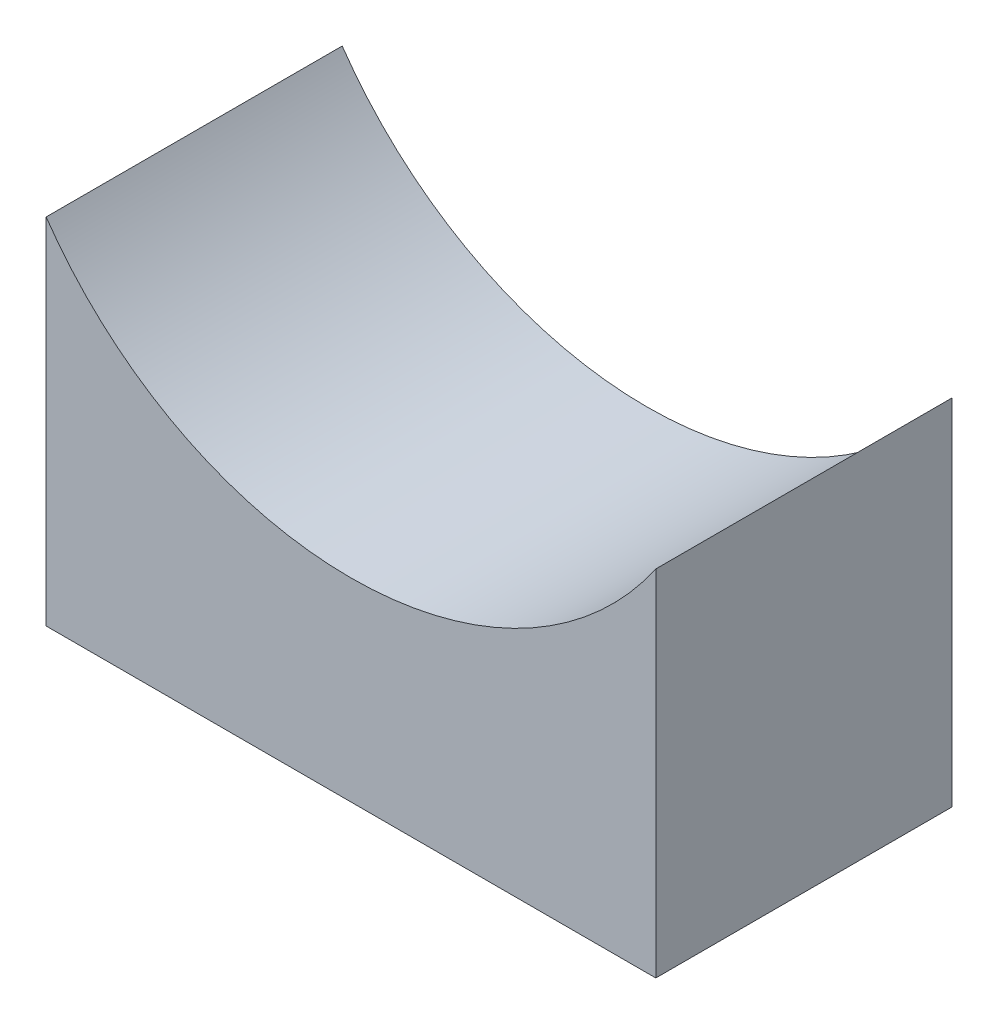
ISO-10303-21;
HEADER;
FILE_DESCRIPTION(('STEP AP214'),'2;1');
FILE_NAME('part.step','',(''),(''),'','','');
FILE_SCHEMA(('AUTOMOTIVE_DESIGN { 1 0 10303 214 1 1 1 1 }'));
ENDSEC;
DATA;
#1=APPLICATION_CONTEXT('core data for automotive mechanical design processes');
#2=APPLICATION_PROTOCOL_DEFINITION('international standard','automotive_design',2000,#1);
#3=PRODUCT_CONTEXT('',#1,'mechanical');
#4=PRODUCT('Part','Part','',(#3));
#5=PRODUCT_RELATED_PRODUCT_CATEGORY('part','',(#4));
#6=PRODUCT_DEFINITION_FORMATION('','',#4);
#7=PRODUCT_DEFINITION_CONTEXT('part definition',#1,'design');
#8=PRODUCT_DEFINITION('design','',#6,#7);
#9=PRODUCT_DEFINITION_SHAPE('','',#8);
#10=(LENGTH_UNIT() NAMED_UNIT(*) SI_UNIT(.MILLI.,.METRE.));
#11=(NAMED_UNIT(*) PLANE_ANGLE_UNIT() SI_UNIT($,.RADIAN.));
#12=(NAMED_UNIT(*) SI_UNIT($,.STERADIAN.) SOLID_ANGLE_UNIT());
#13=UNCERTAINTY_MEASURE_WITH_UNIT(LENGTH_MEASURE(1.E-05),#10,'distance_accuracy_value','');
#14=(GEOMETRIC_REPRESENTATION_CONTEXT(3) GLOBAL_UNCERTAINTY_ASSIGNED_CONTEXT((#13)) GLOBAL_UNIT_ASSIGNED_CONTEXT((#10,
#11,#12)) REPRESENTATION_CONTEXT('',''));
#15=CARTESIAN_POINT('',(0.,0.,0.));
#16=DIRECTION('',(0.,0.,1.));
#17=DIRECTION('',(1.,0.,0.));
#18=AXIS2_PLACEMENT_3D('',#15,#16,#17);
#19=CARTESIAN_POINT('',(0.,0.,200.));
#20=DIRECTION('',(0.,0.,-1.));
#21=DIRECTION('',(-1.,0.,0.));
#22=AXIS2_PLACEMENT_3D('',#19,#20,#21);
#23=CYLINDRICAL_SURFACE('',#22,250.);
#24=CARTESIAN_POINT('',(0.,0.,0.));
#25=DIRECTION('',(0.,0.,1.));
#26=DIRECTION('',(1.,0.,0.));
#27=AXIS2_PLACEMENT_3D('',#24,#25,#26);
#28=CIRCLE('',#27,250.);
#29=CARTESIAN_POINT('',(-205.914158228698,-141.77220969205,0.));
#30=VERTEX_POINT('',#29);
#31=CARTESIAN_POINT('',(205.914158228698,-141.77220969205,0.));
#32=VERTEX_POINT('',#31);
#33=EDGE_CURVE('E98',#30,#32,#28,.T.);
#34=ORIENTED_EDGE('',*,*,#33,.F.);
#35=DIRECTION('',(0.,0.,-1.));
#36=VECTOR('',#35,1.);
#37=CARTESIAN_POINT('',(-205.914158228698,-141.77220969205,200.));
#38=LINE('',#37,#36);
#39=CARTESIAN_POINT('',(-205.914158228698,-141.77220969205,200.));
#40=VERTEX_POINT('',#39);
#41=EDGE_CURVE('E11',#40,#30,#38,.T.);
#42=ORIENTED_EDGE('',*,*,#41,.F.);
#43=CARTESIAN_POINT('',(0.,0.,200.));
#44=DIRECTION('',(0.,0.,1.));
#45=DIRECTION('',(1.,0.,0.));
#46=AXIS2_PLACEMENT_3D('',#43,#44,#45);
#47=CIRCLE('',#46,250.);
#48=CARTESIAN_POINT('',(205.914158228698,-141.77220969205,200.));
#49=VERTEX_POINT('',#48);
#50=EDGE_CURVE('E83',#40,#49,#47,.T.);
#51=ORIENTED_EDGE('',*,*,#50,.T.);
#52=DIRECTION('',(0.,0.,-1.));
#53=VECTOR('',#52,1.);
#54=CARTESIAN_POINT('',(205.914158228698,-141.77220969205,200.));
#55=LINE('',#54,#53);
#56=EDGE_CURVE('E51',#49,#32,#55,.T.);
#57=ORIENTED_EDGE('',*,*,#56,.T.);
#58=EDGE_LOOP('',(#34,#42,#51,#57));
#59=FACE_BOUND('',#58,.T.);
#60=ADVANCED_FACE('F35',(#59),#23,.F.);
#61=CARTESIAN_POINT('',(-205.914158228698,0.,200.));
#62=DIRECTION('',(1.,0.,0.));
#63=DIRECTION('',(0.,0.,-1.));
#64=AXIS2_PLACEMENT_3D('',#61,#62,#63);
#65=PLANE('',#64);
#66=DIRECTION('',(0.,-1.,0.));
#67=VECTOR('',#66,1.);
#68=CARTESIAN_POINT('',(-205.914158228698,0.,0.));
#69=LINE('',#68,#67);
#70=CARTESIAN_POINT('',(-205.914158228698,-381.075655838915,0.));
#71=VERTEX_POINT('',#70);
#72=EDGE_CURVE('E89',#30,#71,#69,.T.);
#73=ORIENTED_EDGE('',*,*,#72,.T.);
#74=DIRECTION('',(0.,0.,-1.));
#75=VECTOR('',#74,1.);
#76=CARTESIAN_POINT('',(-205.914158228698,-381.075655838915,200.));
#77=LINE('',#76,#75);
#78=CARTESIAN_POINT('',(-205.914158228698,-381.075655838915,200.));
#79=VERTEX_POINT('',#78);
#80=EDGE_CURVE('E43',#79,#71,#77,.T.);
#81=ORIENTED_EDGE('',*,*,#80,.F.);
#82=DIRECTION('',(0.,-1.,0.));
#83=VECTOR('',#82,1.);
#84=CARTESIAN_POINT('',(-205.914158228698,0.,200.));
#85=LINE('',#84,#83);
#86=EDGE_CURVE('E77',#40,#79,#85,.T.);
#87=ORIENTED_EDGE('',*,*,#86,.F.);
#88=ORIENTED_EDGE('',*,*,#41,.T.);
#89=EDGE_LOOP('',(#73,#81,#87,#88));
#90=FACE_BOUND('',#89,.T.);
#91=ADVANCED_FACE('F87',(#90),#65,.F.);
#92=CARTESIAN_POINT('',(0.,-381.075655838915,200.));
#93=DIRECTION('',(0.,1.,0.));
#94=DIRECTION('',(0.,0.,1.));
#95=AXIS2_PLACEMENT_3D('',#92,#93,#94);
#96=PLANE('',#95);
#97=DIRECTION('',(1.,0.,0.));
#98=VECTOR('',#97,1.);
#99=CARTESIAN_POINT('',(0.,-381.075655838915,0.));
#100=LINE('',#99,#98);
#101=CARTESIAN_POINT('',(205.914158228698,-381.075655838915,0.));
#102=VERTEX_POINT('',#101);
#103=EDGE_CURVE('E101',#71,#102,#100,.T.);
#104=ORIENTED_EDGE('',*,*,#103,.T.);
#105=DIRECTION('',(0.,0.,-1.));
#106=VECTOR('',#105,1.);
#107=CARTESIAN_POINT('',(205.914158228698,-381.075655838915,200.));
#108=LINE('',#107,#106);
#109=CARTESIAN_POINT('',(205.914158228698,-381.075655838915,200.));
#110=VERTEX_POINT('',#109);
#111=EDGE_CURVE('E65',#110,#102,#108,.T.);
#112=ORIENTED_EDGE('',*,*,#111,.F.);
#113=DIRECTION('',(1.,0.,0.));
#114=VECTOR('',#113,1.);
#115=CARTESIAN_POINT('',(0.,-381.075655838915,200.));
#116=LINE('',#115,#114);
#117=EDGE_CURVE('E82',#79,#110,#116,.T.);
#118=ORIENTED_EDGE('',*,*,#117,.F.);
#119=ORIENTED_EDGE('',*,*,#80,.T.);
#120=EDGE_LOOP('',(#104,#112,#118,#119));
#121=FACE_BOUND('',#120,.T.);
#122=ADVANCED_FACE('F92',(#121),#96,.F.);
#123=CARTESIAN_POINT('',(205.914158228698,0.,200.));
#124=DIRECTION('',(1.,0.,0.));
#125=DIRECTION('',(0.,0.,-1.));
#126=AXIS2_PLACEMENT_3D('',#123,#124,#125);
#127=PLANE('',#126);
#128=DIRECTION('',(0.,-1.,0.));
#129=VECTOR('',#128,1.);
#130=CARTESIAN_POINT('',(205.914158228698,0.,0.));
#131=LINE('',#130,#129);
#132=EDGE_CURVE('E103',#32,#102,#131,.T.);
#133=ORIENTED_EDGE('',*,*,#132,.F.);
#134=ORIENTED_EDGE('',*,*,#56,.F.);
#135=DIRECTION('',(0.,-1.,0.));
#136=VECTOR('',#135,1.);
#137=CARTESIAN_POINT('',(205.914158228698,0.,200.));
#138=LINE('',#137,#136);
#139=EDGE_CURVE('E93',#49,#110,#138,.T.);
#140=ORIENTED_EDGE('',*,*,#139,.T.);
#141=ORIENTED_EDGE('',*,*,#111,.T.);
#142=EDGE_LOOP('',(#133,#134,#140,#141));
#143=FACE_BOUND('',#142,.T.);
#144=ADVANCED_FACE('F108',(#143),#127,.T.);
#145=CARTESIAN_POINT('',(0.,0.,200.));
#146=DIRECTION('',(0.,0.,1.));
#147=DIRECTION('',(1.,0.,0.));
#148=AXIS2_PLACEMENT_3D('',#145,#146,#147);
#149=PLANE('',#148);
#150=ORIENTED_EDGE('',*,*,#50,.F.);
#151=ORIENTED_EDGE('',*,*,#86,.T.);
#152=ORIENTED_EDGE('',*,*,#117,.T.);
#153=ORIENTED_EDGE('',*,*,#139,.F.);
#154=EDGE_LOOP('',(#150,#151,#152,#153));
#155=FACE_BOUND('',#154,.T.);
#156=ADVANCED_FACE('F79',(#155),#149,.T.);
#157=CARTESIAN_POINT('',(0.,0.,0.));
#158=DIRECTION('',(0.,0.,1.));
#159=DIRECTION('',(1.,0.,0.));
#160=AXIS2_PLACEMENT_3D('',#157,#158,#159);
#161=PLANE('',#160);
#162=ORIENTED_EDGE('',*,*,#33,.T.);
#163=ORIENTED_EDGE('',*,*,#132,.T.);
#164=ORIENTED_EDGE('',*,*,#103,.F.);
#165=ORIENTED_EDGE('',*,*,#72,.F.);
#166=EDGE_LOOP('',(#162,#163,#164,#165));
#167=FACE_BOUND('',#166,.T.);
#168=ADVANCED_FACE('F115',(#167),#161,.F.);
#169=CLOSED_SHELL('',(#60,#91,#122,#144,#156,#168));
#170=MANIFOLD_SOLID_BREP('B2',#169);
#171=ADVANCED_BREP_SHAPE_REPRESENTATION('',(#18,#170),#14);
#172=SHAPE_DEFINITION_REPRESENTATION(#9,#171);
ENDSEC;
END-ISO-10303-21;
